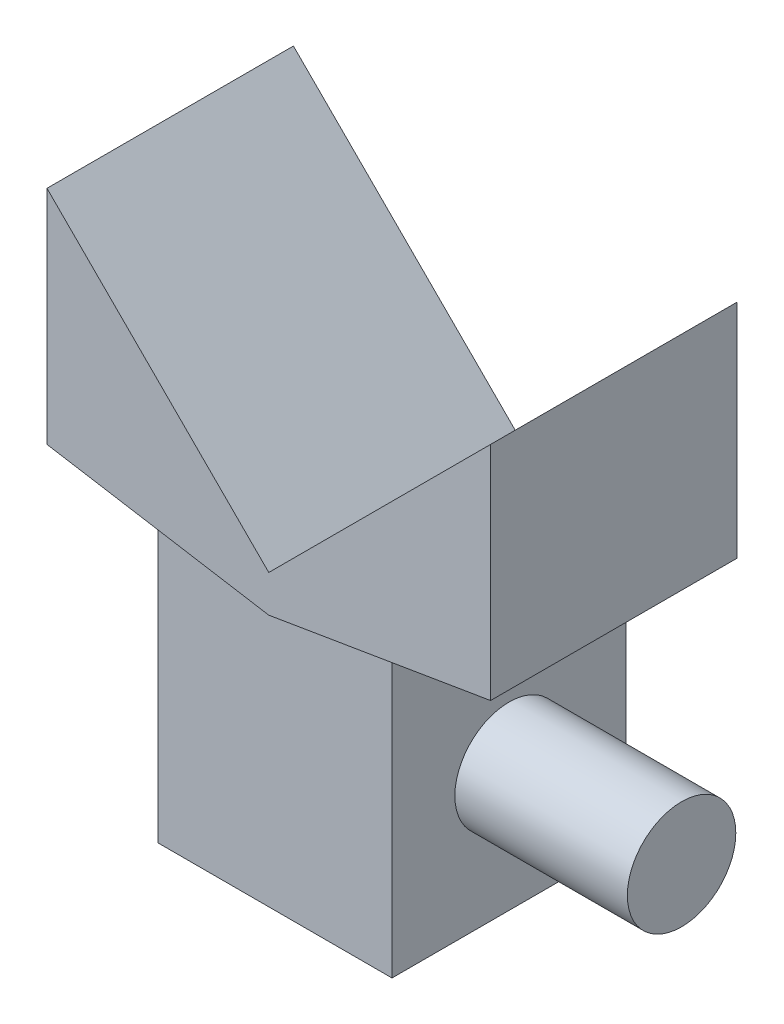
from build123d import *

# Parameters (mm, degrees)
BOSS_EXTRUDE5_DEPTH = 10
BOSS_EXTRUDE6_REACH = 26.94
SKETCH2_W           = 9.5
SKETCH2_H           = 9.5
SKETCH5_R           = 2.2
BOSS_EXTRUDE7_DEPTH = 7


with BuildPart() as part:
    # Sketch1 → Boss-Extrude5 (new body)
    with BuildSketch(Plane.XY):
        Polygon((0, 0), (-9, 9), (-9, 0), (0, -1.5), (9, 0), (9, 9), align=None)
    extrude(amount=BOSS_EXTRUDE5_DEPTH)

    # Sketch2 → Boss-Extrude6 (add, up to next)
    with BuildSketch(Plane(origin=(0, -12, 0), x_dir=(1, 0, 0), z_dir=(0, 1, 0)), mode=Mode.PRIVATE) as boss_extrude6_sk1:
        with Locations((0, -5)):
            Rectangle(SKETCH2_W, SKETCH2_H)
    boss_extrude6_tool1 = extrude(boss_extrude6_sk1.sketch, amount=BOSS_EXTRUDE6_REACH, mode=Mode.PRIVATE) - part.part
    add(boss_extrude6_tool1.solids().sort_by_distance((0, -12, 5))[0])

    # Sketch5 → Boss-Extrude7 (add)
    with BuildSketch(Plane(origin=(4.75, 0, 0), x_dir=(0, 0, -1), z_dir=(1, 0, 0))):
        with Locations(Location((-4.999863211, -6.877630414, 0), (0, 0, 180))):
            Circle(SKETCH5_R)
    extrude(amount=BOSS_EXTRUDE7_DEPTH)


solid = part.part
